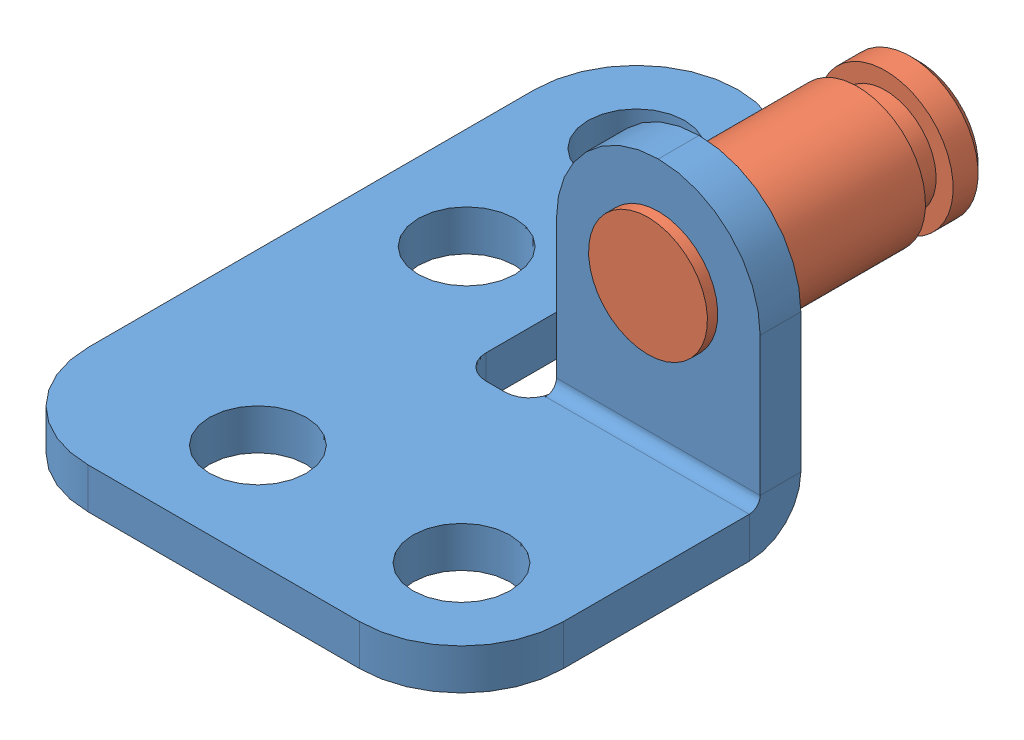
SolidWorks assembly Slingshot Pivot Bracket.SLDASM, configuration Default (file format 6000). Lengths in mm.
Overall size (22.23 13.67 30.4).
2 component instances, 2 part files, 2 mates.
Components (placement in the parent):
- Slingshot Pivot Bkt-1: Slingshot Pivot Bkt.SLDPRT [Default] at origin size (22.23 13.67 30.4)
- Slingshot Pivot Stud-1: Slingshot Pivot Stud.SLDPRT [Default] at (17.4625 6.858 -15.875) x (-0.923728 -0.383049 0) z (0 0 -1) size (6.35 6.35 12.65)
Mates (geometry in assembly coordinates):
- Concentric1: concentric aligned: cylinder of Slingshot Pivot Bkt-1 through (17.4625 6.858 -13.97) axis (0 0 -1) radius 2.3813; cylinder of Slingshot Pivot Stud-1 through (17.4625 6.858 -13.4874) axis (0 0 -1) radius 2.7813
- Coincident1: coincident anti-aligned: plane of Slingshot Pivot Bkt-1 through (0 0 -15.875) normal (0 0 -1); plane of Slingshot Pivot Stud-1 through (17.4625 6.858 -15.875) normal (0 0 1)
